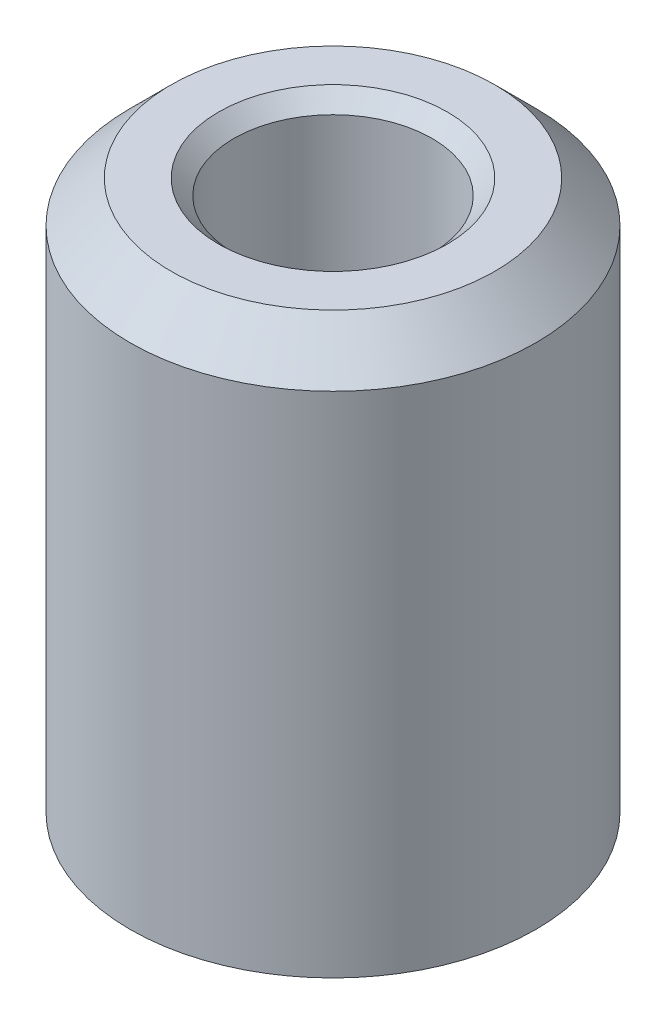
ISO-10303-21;
HEADER;
FILE_DESCRIPTION(('STEP AP214'),'2;1');
FILE_NAME('part.step','',(''),(''),'','','');
FILE_SCHEMA(('AUTOMOTIVE_DESIGN { 1 0 10303 214 1 1 1 1 }'));
ENDSEC;
DATA;
#1=APPLICATION_CONTEXT('core data for automotive mechanical design processes');
#2=APPLICATION_PROTOCOL_DEFINITION('international standard','automotive_design',2000,#1);
#3=PRODUCT_CONTEXT('',#1,'mechanical');
#4=PRODUCT('Part','Part','',(#3));
#5=PRODUCT_RELATED_PRODUCT_CATEGORY('part','',(#4));
#6=PRODUCT_DEFINITION_FORMATION('','',#4);
#7=PRODUCT_DEFINITION_CONTEXT('part definition',#1,'design');
#8=PRODUCT_DEFINITION('design','',#6,#7);
#9=PRODUCT_DEFINITION_SHAPE('','',#8);
#10=(LENGTH_UNIT() NAMED_UNIT(*) SI_UNIT(.MILLI.,.METRE.));
#11=(NAMED_UNIT(*) PLANE_ANGLE_UNIT() SI_UNIT($,.RADIAN.));
#12=(NAMED_UNIT(*) SI_UNIT($,.STERADIAN.) SOLID_ANGLE_UNIT());
#13=UNCERTAINTY_MEASURE_WITH_UNIT(LENGTH_MEASURE(1.E-05),#10,'distance_accuracy_value','');
#14=(GEOMETRIC_REPRESENTATION_CONTEXT(3) GLOBAL_UNCERTAINTY_ASSIGNED_CONTEXT((#13)) GLOBAL_UNIT_ASSIGNED_CONTEXT((#10,
#11,#12)) REPRESENTATION_CONTEXT('',''));
#15=CARTESIAN_POINT('',(0.,0.,0.));
#16=DIRECTION('',(0.,0.,1.));
#17=DIRECTION('',(1.,0.,0.));
#18=AXIS2_PLACEMENT_3D('',#15,#16,#17);
#19=CARTESIAN_POINT('',(0.,18.,0.));
#20=DIRECTION('',(0.,-1.,0.));
#21=DIRECTION('',(0.,0.,-1.));
#22=AXIS2_PLACEMENT_3D('',#19,#20,#21);
#23=CYLINDRICAL_SURFACE('',#22,6.65);
#24=CARTESIAN_POINT('',(0.,16.65,0.));
#25=DIRECTION('',(0.,1.,0.));
#26=DIRECTION('',(0.,0.,1.));
#27=AXIS2_PLACEMENT_3D('',#24,#25,#26);
#28=CIRCLE('',#27,6.65);
#29=CARTESIAN_POINT('',(0.,16.65,-6.65));
#30=VERTEX_POINT('',#29);
#31=EDGE_CURVE('E46',#30,#30,#28,.F.);
#32=ORIENTED_EDGE('',*,*,#31,.T.);
#33=EDGE_LOOP('',(#32));
#34=FACE_BOUND('',#33,.T.);
#35=CARTESIAN_POINT('',(0.,0.,0.));
#36=DIRECTION('',(0.,1.,0.));
#37=DIRECTION('',(0.,0.,1.));
#38=AXIS2_PLACEMENT_3D('',#35,#36,#37);
#39=CIRCLE('',#38,6.65);
#40=CARTESIAN_POINT('',(0.,0.,6.65));
#41=VERTEX_POINT('',#40);
#42=EDGE_CURVE('E55',#41,#41,#39,.T.);
#43=ORIENTED_EDGE('',*,*,#42,.T.);
#44=EDGE_LOOP('',(#43));
#45=FACE_BOUND('',#44,.T.);
#46=ADVANCED_FACE('F35',(#34,#45),#23,.T.);
#47=CARTESIAN_POINT('',(0.,18.,0.));
#48=DIRECTION('',(0.,1.,0.));
#49=DIRECTION('',(0.,0.,1.));
#50=AXIS2_PLACEMENT_3D('',#47,#48,#49);
#51=PLANE('',#50);
#52=CARTESIAN_POINT('',(0.,18.,0.));
#53=DIRECTION('',(0.,1.,0.));
#54=DIRECTION('',(0.,0.,1.));
#55=AXIS2_PLACEMENT_3D('',#52,#53,#54);
#56=CIRCLE('',#55,3.75);
#57=CARTESIAN_POINT('',(0.,18.,3.75));
#58=VERTEX_POINT('',#57);
#59=EDGE_CURVE('E10',#58,#58,#56,.F.);
#60=ORIENTED_EDGE('',*,*,#59,.T.);
#61=EDGE_LOOP('',(#60));
#62=FACE_BOUND('',#61,.T.);
#63=CARTESIAN_POINT('',(0.,18.,0.));
#64=DIRECTION('',(0.,1.,0.));
#65=DIRECTION('',(0.,0.,1.));
#66=AXIS2_PLACEMENT_3D('',#63,#64,#65);
#67=CIRCLE('',#66,5.3);
#68=CARTESIAN_POINT('',(0.,18.,-5.3));
#69=VERTEX_POINT('',#68);
#70=EDGE_CURVE('E50',#69,#69,#67,.T.);
#71=ORIENTED_EDGE('',*,*,#70,.T.);
#72=EDGE_LOOP('',(#71));
#73=FACE_BOUND('',#72,.T.);
#74=ADVANCED_FACE('F77',(#62,#73),#51,.T.);
#75=CARTESIAN_POINT('',(0.,0.,0.));
#76=DIRECTION('',(0.,1.,0.));
#77=DIRECTION('',(0.,0.,1.));
#78=AXIS2_PLACEMENT_3D('',#75,#76,#77);
#79=PLANE('',#78);
#80=CARTESIAN_POINT('',(0.,0.,0.));
#81=DIRECTION('',(0.,1.,0.));
#82=DIRECTION('',(0.,0.,1.));
#83=AXIS2_PLACEMENT_3D('',#80,#81,#82);
#84=CIRCLE('',#83,3.25);
#85=CARTESIAN_POINT('',(0.,0.,3.25));
#86=VERTEX_POINT('',#85);
#87=EDGE_CURVE('E58',#86,#86,#84,.T.);
#88=ORIENTED_EDGE('',*,*,#87,.T.);
#89=EDGE_LOOP('',(#88));
#90=FACE_BOUND('',#89,.T.);
#91=ORIENTED_EDGE('',*,*,#42,.F.);
#92=EDGE_LOOP('',(#91));
#93=FACE_BOUND('',#92,.T.);
#94=ADVANCED_FACE('F62',(#90,#93),#79,.F.);
#95=CARTESIAN_POINT('',(0.,18.,0.));
#96=DIRECTION('',(0.,-1.,0.));
#97=DIRECTION('',(0.,0.,-1.));
#98=AXIS2_PLACEMENT_3D('',#95,#96,#97);
#99=CONICAL_SURFACE('',#98,5.3,0.785398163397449);
#100=CARTESIAN_POINT('',(0.,16.65,-6.65));
#101=CARTESIAN_POINT('',(0.,16.6640625,-6.6359375));
#102=CARTESIAN_POINT('',(0.,16.678125,-6.621875));
#103=CARTESIAN_POINT('',(0.,16.70625,-6.59375));
#104=CARTESIAN_POINT('',(0.,16.7203125,-6.5796875));
#105=CARTESIAN_POINT('',(0.,16.7484375,-6.5515625));
#106=CARTESIAN_POINT('',(0.,16.7625,-6.5375));
#107=CARTESIAN_POINT('',(0.,16.790625,-6.509375));
#108=CARTESIAN_POINT('',(0.,16.8046875,-6.4953125));
#109=CARTESIAN_POINT('',(0.,16.8328125,-6.4671875));
#110=CARTESIAN_POINT('',(0.,16.846875,-6.453125));
#111=CARTESIAN_POINT('',(0.,16.875,-6.425));
#112=CARTESIAN_POINT('',(0.,16.8890625,-6.4109375));
#113=CARTESIAN_POINT('',(0.,16.9171875,-6.3828125));
#114=CARTESIAN_POINT('',(0.,16.93125,-6.36875));
#115=CARTESIAN_POINT('',(0.,16.959375,-6.340625));
#116=CARTESIAN_POINT('',(0.,16.9734375,-6.3265625));
#117=CARTESIAN_POINT('',(0.,17.0015625,-6.2984375));
#118=CARTESIAN_POINT('',(0.,17.015625,-6.284375));
#119=CARTESIAN_POINT('',(0.,17.04375,-6.25625));
#120=CARTESIAN_POINT('',(0.,17.0578125,-6.2421875));
#121=CARTESIAN_POINT('',(0.,17.0859375,-6.2140625));
#122=CARTESIAN_POINT('',(0.,17.1,-6.2));
#123=CARTESIAN_POINT('',(0.,17.128125,-6.171875));
#124=CARTESIAN_POINT('',(0.,17.1421875,-6.1578125));
#125=CARTESIAN_POINT('',(0.,17.1703125,-6.1296875));
#126=CARTESIAN_POINT('',(0.,17.184375,-6.115625));
#127=CARTESIAN_POINT('',(0.,17.2125,-6.0875));
#128=CARTESIAN_POINT('',(0.,17.2265625,-6.0734375));
#129=CARTESIAN_POINT('',(0.,17.2546875,-6.0453125));
#130=CARTESIAN_POINT('',(0.,17.26875,-6.03125));
#131=CARTESIAN_POINT('',(0.,17.296875,-6.003125));
#132=CARTESIAN_POINT('',(0.,17.3109375,-5.9890625));
#133=CARTESIAN_POINT('',(0.,17.3390625,-5.9609375));
#134=CARTESIAN_POINT('',(0.,17.353125,-5.946875));
#135=CARTESIAN_POINT('',(0.,17.38125,-5.91875));
#136=CARTESIAN_POINT('',(0.,17.3953125,-5.9046875));
#137=CARTESIAN_POINT('',(0.,17.4234375,-5.8765625));
#138=CARTESIAN_POINT('',(0.,17.4375,-5.8625));
#139=CARTESIAN_POINT('',(0.,17.465625,-5.834375));
#140=CARTESIAN_POINT('',(0.,17.4796875,-5.8203125));
#141=CARTESIAN_POINT('',(0.,17.5078125,-5.7921875));
#142=CARTESIAN_POINT('',(0.,17.521875,-5.778125));
#143=CARTESIAN_POINT('',(0.,17.55,-5.75));
#144=CARTESIAN_POINT('',(0.,17.5640625,-5.7359375));
#145=CARTESIAN_POINT('',(0.,17.5921875,-5.7078125));
#146=CARTESIAN_POINT('',(0.,17.60625,-5.69375));
#147=CARTESIAN_POINT('',(0.,17.634375,-5.665625));
#148=CARTESIAN_POINT('',(0.,17.6484375,-5.6515625));
#149=CARTESIAN_POINT('',(0.,17.6765625,-5.6234375));
#150=CARTESIAN_POINT('',(0.,17.690625,-5.609375));
#151=CARTESIAN_POINT('',(0.,17.71875,-5.58125));
#152=CARTESIAN_POINT('',(0.,17.7328125,-5.5671875));
#153=CARTESIAN_POINT('',(0.,17.7609375,-5.5390625));
#154=CARTESIAN_POINT('',(0.,17.775,-5.525));
#155=CARTESIAN_POINT('',(0.,17.803125,-5.496875));
#156=CARTESIAN_POINT('',(0.,17.8171875,-5.4828125));
#157=CARTESIAN_POINT('',(0.,17.8453125,-5.4546875));
#158=CARTESIAN_POINT('',(0.,17.859375,-5.440625));
#159=CARTESIAN_POINT('',(0.,17.8875,-5.4125));
#160=CARTESIAN_POINT('',(0.,17.9015625,-5.3984375));
#161=CARTESIAN_POINT('',(0.,17.9296875,-5.3703125));
#162=CARTESIAN_POINT('',(0.,17.94375,-5.35625));
#163=CARTESIAN_POINT('',(0.,17.971875,-5.328125));
#164=CARTESIAN_POINT('',(0.,17.9859375,-5.3140625));
#165=CARTESIAN_POINT('',(0.,18.,-5.3));
#166=B_SPLINE_CURVE_WITH_KNOTS('',3,(#100,#101,#102,#103,#104,#105,#106,#107,#108,#109,#110,
#111,#112,#113,#114,#115,#116,#117,#118,#119,#120,#121,#122,#123,#124,#125,#126,#127,#128,#129,
#130,#131,#132,#133,#134,#135,#136,#137,#138,#139,#140,#141,#142,#143,#144,#145,#146,#147,#148,
#149,#150,#151,#152,#153,#154,#155,#156,#157,#158,#159,#160,#161,#162,#163,#164,#165),
.UNSPECIFIED.,.F.,.F.,(4,2,2,2,2,2,2,2,2,2,2,2,2,2,2,2,2,2,2,2,2,2,2,2,2,2,2,2,2,2,2,2,4),(0.,
0.059662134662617,0.119324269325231,0.178986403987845,0.238648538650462,0.298310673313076,
0.357972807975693,0.417634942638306,0.477297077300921,0.536959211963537,0.596621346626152,
0.656283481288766,0.715945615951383,0.775607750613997,0.83526988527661,0.894932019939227,
0.954594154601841,1.01425628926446,1.07391842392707,1.13358055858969,1.1932426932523,
1.25290482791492,1.31256696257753,1.37222909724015,1.43189123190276,1.49155336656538,
1.55121550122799,1.61087763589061,1.67053977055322,1.73020190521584,1.78986403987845,
1.84952617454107,1.90918830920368),.UNSPECIFIED.);
#167=EDGE_CURVE('BSEAM67',#30,#69,#166,.T.);
#168=ORIENTED_EDGE('',*,*,#31,.F.);
#169=ORIENTED_EDGE('',*,*,#70,.F.);
#170=ORIENTED_EDGE('',*,*,#167,.T.);
#171=ORIENTED_EDGE('',*,*,#167,.F.);
#172=EDGE_LOOP('',(#168,#170,#169,#171));
#173=FACE_BOUND('',#172,.T.);
#174=ADVANCED_FACE('F67',(#173),#99,.T.);
#175=CARTESIAN_POINT('',(0.,0.,0.));
#176=DIRECTION('',(0.,1.,0.));
#177=DIRECTION('',(0.,0.,1.));
#178=AXIS2_PLACEMENT_3D('',#175,#176,#177);
#179=CYLINDRICAL_SURFACE('',#178,3.25);
#180=CARTESIAN_POINT('',(0.,17.5,0.));
#181=DIRECTION('',(0.,1.,0.));
#182=DIRECTION('',(0.,0.,1.));
#183=AXIS2_PLACEMENT_3D('',#180,#181,#182);
#184=CIRCLE('',#183,3.25);
#185=CARTESIAN_POINT('',(0.,17.5,3.25));
#186=VERTEX_POINT('',#185);
#187=EDGE_CURVE('E42',#186,#186,#184,.T.);
#188=ORIENTED_EDGE('',*,*,#187,.T.);
#189=EDGE_LOOP('',(#188));
#190=FACE_BOUND('',#189,.T.);
#191=ORIENTED_EDGE('',*,*,#87,.F.);
#192=EDGE_LOOP('',(#191));
#193=FACE_BOUND('',#192,.T.);
#194=ADVANCED_FACE('F65',(#190,#193),#179,.F.);
#195=CARTESIAN_POINT('',(0.,17.5,0.));
#196=DIRECTION('',(0.,1.,0.));
#197=DIRECTION('',(0.,0.,1.));
#198=AXIS2_PLACEMENT_3D('',#195,#196,#197);
#199=CONICAL_SURFACE('',#198,3.25,0.785398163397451);
#200=ORIENTED_EDGE('',*,*,#59,.F.);
#201=EDGE_LOOP('',(#200));
#202=FACE_BOUND('',#201,.T.);
#203=ORIENTED_EDGE('',*,*,#187,.F.);
#204=EDGE_LOOP('',(#203));
#205=FACE_BOUND('',#204,.T.);
#206=ADVANCED_FACE('F37',(#202,#205),#199,.F.);
#207=CLOSED_SHELL('',(#46,#74,#94,#174,#194,#206));
#208=MANIFOLD_SOLID_BREP('B2',#207);
#209=ADVANCED_BREP_SHAPE_REPRESENTATION('',(#18,#208),#14);
#210=SHAPE_DEFINITION_REPRESENTATION(#9,#209);
ENDSEC;
END-ISO-10303-21;
